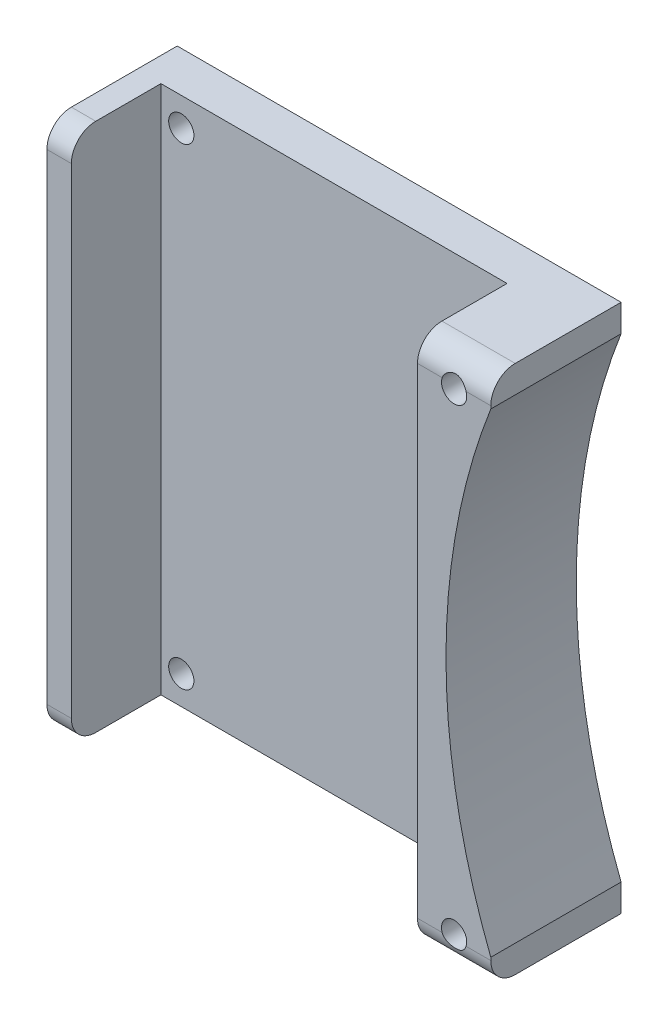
ISO-10303-21;
HEADER;
FILE_DESCRIPTION(('STEP AP214'),'2;1');
FILE_NAME('part.step','',(''),(''),'','','');
FILE_SCHEMA(('AUTOMOTIVE_DESIGN { 1 0 10303 214 1 1 1 1 }'));
ENDSEC;
DATA;
#1=APPLICATION_CONTEXT('core data for automotive mechanical design processes');
#2=APPLICATION_PROTOCOL_DEFINITION('international standard','automotive_design',2000,#1);
#3=PRODUCT_CONTEXT('',#1,'mechanical');
#4=PRODUCT('Part','Part','',(#3));
#5=PRODUCT_RELATED_PRODUCT_CATEGORY('part','',(#4));
#6=PRODUCT_DEFINITION_FORMATION('','',#4);
#7=PRODUCT_DEFINITION_CONTEXT('part definition',#1,'design');
#8=PRODUCT_DEFINITION('design','',#6,#7);
#9=PRODUCT_DEFINITION_SHAPE('','',#8);
#10=(LENGTH_UNIT() NAMED_UNIT(*) SI_UNIT(.MILLI.,.METRE.));
#11=(NAMED_UNIT(*) PLANE_ANGLE_UNIT() SI_UNIT($,.RADIAN.));
#12=(NAMED_UNIT(*) SI_UNIT($,.STERADIAN.) SOLID_ANGLE_UNIT());
#13=UNCERTAINTY_MEASURE_WITH_UNIT(LENGTH_MEASURE(1.E-05),#10,'distance_accuracy_value','');
#14=(GEOMETRIC_REPRESENTATION_CONTEXT(3) GLOBAL_UNCERTAINTY_ASSIGNED_CONTEXT((#13)) GLOBAL_UNIT_ASSIGNED_CONTEXT((#10,
#11,#12)) REPRESENTATION_CONTEXT('',''));
#15=CARTESIAN_POINT('',(0.,0.,0.));
#16=DIRECTION('',(0.,0.,1.));
#17=DIRECTION('',(1.,0.,0.));
#18=AXIS2_PLACEMENT_3D('',#15,#16,#17);
#19=CARTESIAN_POINT('',(22.75,-29.,-16.));
#20=DIRECTION('',(0.,0.,1.));
#21=DIRECTION('',(1.,0.,0.));
#22=AXIS2_PLACEMENT_3D('',#19,#20,#21);
#23=CYLINDRICAL_SURFACE('',#22,1.55);
#24=CARTESIAN_POINT('',(22.75,-29.,0.));
#25=DIRECTION('',(0.,0.,1.));
#26=DIRECTION('',(1.,0.,0.));
#27=AXIS2_PLACEMENT_3D('',#24,#25,#26);
#28=CIRCLE('',#27,1.55);
#29=CARTESIAN_POINT('',(21.2828599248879,-29.5,0.));
#30=VERTEX_POINT('',#29);
#31=CARTESIAN_POINT('',(24.2171400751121,-29.5000000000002,0.));
#32=VERTEX_POINT('',#31);
#33=EDGE_CURVE('E134',#30,#32,#28,.F.);
#34=ORIENTED_EDGE('',*,*,#33,.F.);
#35=CARTESIAN_POINT('',(24.217140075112,-29.5000000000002,0.));
#36=CARTESIAN_POINT('',(24.2034915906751,-29.5400543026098,3.61119810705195E-06));
#37=CARTESIAN_POINT('',(24.1882069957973,-29.5795229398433,-0.000802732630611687));
#38=CARTESIAN_POINT('',(24.154498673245,-29.6570143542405,-0.00386157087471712));
#39=CARTESIAN_POINT('',(24.1360766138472,-29.6950378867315,-0.00611329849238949));
#40=CARTESIAN_POINT('',(24.0764521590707,-29.8062698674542,-0.0147525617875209));
#41=CARTESIAN_POINT('',(24.0307708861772,-29.8769912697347,-0.0230271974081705));
#42=CARTESIAN_POINT('',(23.9289916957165,-30.0096904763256,-0.0428515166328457));
#43=CARTESIAN_POINT('',(23.872909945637,-30.0716815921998,-0.0543961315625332));
#44=CARTESIAN_POINT('',(23.75164367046,-30.185810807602,-0.0788575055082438));
#45=CARTESIAN_POINT('',(23.6864502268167,-30.2379391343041,-0.0917756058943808));
#46=CARTESIAN_POINT('',(23.5450672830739,-30.3334153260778,-0.117641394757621));
#47=CARTESIAN_POINT('',(23.468494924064,-30.3762060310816,-0.130559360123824));
#48=CARTESIAN_POINT('',(23.308886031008,-30.4483820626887,-0.153596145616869));
#49=CARTESIAN_POINT('',(23.2258516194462,-30.477771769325,-0.163715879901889));
#50=CARTESIAN_POINT('',(23.0566001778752,-30.5218566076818,-0.179298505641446));
#51=CARTESIAN_POINT('',(22.9704334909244,-30.5367243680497,-0.184815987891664));
#52=CARTESIAN_POINT('',(22.7966674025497,-30.5517472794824,-0.190391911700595));
#53=CARTESIAN_POINT('',(22.7090685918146,-30.5519083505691,-0.190452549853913));
#54=CARTESIAN_POINT('',(22.5402134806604,-30.5379402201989,-0.185266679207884));
#55=CARTESIAN_POINT('',(22.4588790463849,-30.5246202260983,-0.180320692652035));
#56=CARTESIAN_POINT('',(22.299667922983,-30.4854042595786,-0.166379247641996));
#57=CARTESIAN_POINT('',(22.2217918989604,-30.4595058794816,-0.157383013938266));
#58=CARTESIAN_POINT('',(22.0699866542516,-30.3953502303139,-0.136522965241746));
#59=CARTESIAN_POINT('',(21.9961590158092,-30.3568700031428,-0.12460847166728));
#60=CARTESIAN_POINT('',(21.8556766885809,-30.2686879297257,-0.0997910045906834));
#61=CARTESIAN_POINT('',(21.7890264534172,-30.2189791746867,-0.0868874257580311));
#62=CARTESIAN_POINT('',(21.6607995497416,-30.1062756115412,-0.0613000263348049));
#63=CARTESIAN_POINT('',(21.5997398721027,-30.0426783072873,-0.0486721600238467));
#64=CARTESIAN_POINT('',(21.4891123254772,-29.9057483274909,-0.0267614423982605));
#65=CARTESIAN_POINT('',(21.439525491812,-29.8324320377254,-0.0174730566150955));
#66=CARTESIAN_POINT('',(21.3737851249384,-29.7146392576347,-0.00740862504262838));
#67=CARTESIAN_POINT('',(21.3529052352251,-29.6729052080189,-0.00468419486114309));
#68=CARTESIAN_POINT('',(21.3149734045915,-29.5876853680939,-0.000977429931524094));
#69=CARTESIAN_POINT('',(21.2979195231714,-29.544200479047,5.78968746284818E-06));
#70=CARTESIAN_POINT('',(21.2828599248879,-29.5000000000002,0.));
#71=B_SPLINE_CURVE_WITH_KNOTS('',3,(#35,#36,#37,#38,#39,#40,#41,#42,#43,#44,#45,#46,#47,#48,#49,
#50,#51,#52,#53,#54,#55,#56,#57,#58,#59,#60,#61,#62,#63,#64,#65,#66,#67,#68,#69,#70),
.UNSPECIFIED.,.F.,.F.,(4,2,2,2,2,2,2,2,2,2,2,2,2,2,2,2,2,4),(0.,0.126855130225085,
0.253643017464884,0.506119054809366,0.758205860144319,1.01054115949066,1.27527280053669,
1.53991785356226,1.80137721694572,2.06273133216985,2.30927643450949,2.55586874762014,
2.80709189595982,3.05847004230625,3.32439890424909,3.58988499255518,3.72992282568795,
3.86988947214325),.UNSPECIFIED.);
#72=EDGE_CURVE('E188',#32,#30,#71,.T.);
#73=ORIENTED_EDGE('',*,*,#72,.F.);
#74=EDGE_LOOP('',(#34,#73));
#75=FACE_BOUND('',#74,.T.);
#76=CARTESIAN_POINT('',(22.75,-29.,-13.5));
#77=DIRECTION('',(0.,0.,1.));
#78=DIRECTION('',(1.,0.,0.));
#79=AXIS2_PLACEMENT_3D('',#76,#77,#78);
#80=CIRCLE('',#79,1.55);
#81=CARTESIAN_POINT('',(24.3,-29.,-13.5));
#82=VERTEX_POINT('',#81);
#83=EDGE_CURVE('E135',#82,#82,#80,.F.);
#84=ORIENTED_EDGE('',*,*,#83,.T.);
#85=EDGE_LOOP('',(#84));
#86=FACE_BOUND('',#85,.T.);
#87=ADVANCED_FACE('F16',(#75,#86),#23,.F.);
#88=CARTESIAN_POINT('',(22.75,29.,-16.));
#89=DIRECTION('',(0.,0.,1.));
#90=DIRECTION('',(1.,0.,0.));
#91=AXIS2_PLACEMENT_3D('',#88,#89,#90);
#92=CYLINDRICAL_SURFACE('',#91,1.55);
#93=CARTESIAN_POINT('',(22.75,29.,-13.5));
#94=DIRECTION('',(0.,0.,1.));
#95=DIRECTION('',(1.,0.,0.));
#96=AXIS2_PLACEMENT_3D('',#93,#94,#95);
#97=CIRCLE('',#96,1.55);
#98=CARTESIAN_POINT('',(24.3,29.,-13.5));
#99=VERTEX_POINT('',#98);
#100=EDGE_CURVE('E202',#99,#99,#97,.F.);
#101=ORIENTED_EDGE('',*,*,#100,.T.);
#102=EDGE_LOOP('',(#101));
#103=FACE_BOUND('',#102,.T.);
#104=CARTESIAN_POINT('',(22.75,29.,0.));
#105=DIRECTION('',(0.,0.,1.));
#106=DIRECTION('',(1.,0.,0.));
#107=AXIS2_PLACEMENT_3D('',#104,#105,#106);
#108=CIRCLE('',#107,1.55);
#109=CARTESIAN_POINT('',(24.2171400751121,29.5000000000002,0.));
#110=VERTEX_POINT('',#109);
#111=CARTESIAN_POINT('',(21.2828599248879,29.5000000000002,0.));
#112=VERTEX_POINT('',#111);
#113=EDGE_CURVE('E127',#110,#112,#108,.F.);
#114=ORIENTED_EDGE('',*,*,#113,.F.);
#115=CARTESIAN_POINT('',(21.282859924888,29.5000000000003,0.));
#116=CARTESIAN_POINT('',(21.2965084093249,29.5400543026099,3.61119810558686E-06));
#117=CARTESIAN_POINT('',(21.3117930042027,29.5795229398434,-0.000802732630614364));
#118=CARTESIAN_POINT('',(21.345501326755,29.6570143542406,-0.00386157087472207));
#119=CARTESIAN_POINT('',(21.3639233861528,29.6950378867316,-0.00611329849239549));
#120=CARTESIAN_POINT('',(21.4235478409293,29.8062698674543,-0.0147525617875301));
#121=CARTESIAN_POINT('',(21.4692291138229,29.8769912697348,-0.0230271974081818));
#122=CARTESIAN_POINT('',(21.5710083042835,30.0096904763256,-0.0428515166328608));
#123=CARTESIAN_POINT('',(21.627090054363,30.0716815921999,-0.0543961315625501));
#124=CARTESIAN_POINT('',(21.7483563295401,30.1858108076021,-0.0788575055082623));
#125=CARTESIAN_POINT('',(21.8135497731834,30.2379391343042,-0.0917756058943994));
#126=CARTESIAN_POINT('',(21.9549327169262,30.3334153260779,-0.117641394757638));
#127=CARTESIAN_POINT('',(22.0315050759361,30.3762060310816,-0.130559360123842));
#128=CARTESIAN_POINT('',(22.1911139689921,30.4483820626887,-0.153596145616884));
#129=CARTESIAN_POINT('',(22.2741483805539,30.477771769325,-0.163715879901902));
#130=CARTESIAN_POINT('',(22.4433998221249,30.5218566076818,-0.179298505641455));
#131=CARTESIAN_POINT('',(22.5295665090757,30.5367243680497,-0.18481598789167));
#132=CARTESIAN_POINT('',(22.7033325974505,30.5517472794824,-0.190391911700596));
#133=CARTESIAN_POINT('',(22.7909314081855,30.551908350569,-0.190452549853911));
#134=CARTESIAN_POINT('',(22.9597865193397,30.5379402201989,-0.185266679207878));
#135=CARTESIAN_POINT('',(23.0411209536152,30.5246202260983,-0.180320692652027));
#136=CARTESIAN_POINT('',(23.2003320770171,30.4854042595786,-0.166379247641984));
#137=CARTESIAN_POINT('',(23.2782081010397,30.4595058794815,-0.157383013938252));
#138=CARTESIAN_POINT('',(23.4300133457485,30.3953502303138,-0.13652296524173));
#139=CARTESIAN_POINT('',(23.5038409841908,30.3568700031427,-0.124608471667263));
#140=CARTESIAN_POINT('',(23.6443233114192,30.2686879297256,-0.0997910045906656));
#141=CARTESIAN_POINT('',(23.7109735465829,30.2189791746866,-0.0868874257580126));
#142=CARTESIAN_POINT('',(23.8392004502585,30.1062756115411,-0.0613000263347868));
#143=CARTESIAN_POINT('',(23.9002601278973,30.0426783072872,-0.0486721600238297));
#144=CARTESIAN_POINT('',(24.0108876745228,29.9057483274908,-0.0267614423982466));
#145=CARTESIAN_POINT('',(24.0604745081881,29.8324320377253,-0.0174730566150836));
#146=CARTESIAN_POINT('',(24.1262148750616,29.7146392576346,-0.0074086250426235));
#147=CARTESIAN_POINT('',(24.1470947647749,29.6729052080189,-0.0046841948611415));
#148=CARTESIAN_POINT('',(24.1850265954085,29.5876853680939,-0.000977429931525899));
#149=CARTESIAN_POINT('',(24.2020804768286,29.5442004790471,5.78968746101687E-06));
#150=CARTESIAN_POINT('',(24.217140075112,29.5000000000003,0.));
#151=B_SPLINE_CURVE_WITH_KNOTS('',3,(#115,#116,#117,#118,#119,#120,#121,#122,#123,#124,#125,
#126,#127,#128,#129,#130,#131,#132,#133,#134,#135,#136,#137,#138,#139,#140,#141,#142,#143,#144,
#145,#146,#147,#148,#149,#150),.UNSPECIFIED.,.F.,.F.,(4,2,2,2,2,2,2,2,2,2,2,2,2,2,2,2,2,4),(0.,
0.126855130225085,0.253643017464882,0.506119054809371,0.758205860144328,1.01054115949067,
1.27527280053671,1.53991785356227,1.80137721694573,2.06273133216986,2.3092764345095,
2.55586874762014,2.80709189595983,3.05847004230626,3.3243989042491,3.5898849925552,
3.72992282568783,3.86988947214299),.UNSPECIFIED.);
#152=EDGE_CURVE('E132',#112,#110,#151,.T.);
#153=ORIENTED_EDGE('',*,*,#152,.F.);
#154=EDGE_LOOP('',(#114,#153));
#155=FACE_BOUND('',#154,.T.);
#156=ADVANCED_FACE('F130',(#103,#155),#92,.F.);
#157=CARTESIAN_POINT('',(-21.75,29.,-16.));
#158=DIRECTION('',(0.,0.,1.));
#159=DIRECTION('',(1.,0.,0.));
#160=AXIS2_PLACEMENT_3D('',#157,#158,#159);
#161=CYLINDRICAL_SURFACE('',#160,1.55);
#162=CARTESIAN_POINT('',(-21.75,29.,-13.5));
#163=DIRECTION('',(0.,0.,1.));
#164=DIRECTION('',(1.,0.,0.));
#165=AXIS2_PLACEMENT_3D('',#162,#163,#164);
#166=CIRCLE('',#165,1.55);
#167=CARTESIAN_POINT('',(-20.2,29.,-13.5));
#168=VERTEX_POINT('',#167);
#169=EDGE_CURVE('E20',#168,#168,#166,.F.);
#170=ORIENTED_EDGE('',*,*,#169,.T.);
#171=EDGE_LOOP('',(#170));
#172=FACE_BOUND('',#171,.T.);
#173=CARTESIAN_POINT('',(-21.75,29.,-11.));
#174=DIRECTION('',(0.,0.,1.));
#175=DIRECTION('',(1.,0.,0.));
#176=AXIS2_PLACEMENT_3D('',#173,#174,#175);
#177=CIRCLE('',#176,1.55);
#178=CARTESIAN_POINT('',(-20.2,29.,-11.));
#179=VERTEX_POINT('',#178);
#180=EDGE_CURVE('E376',#179,#179,#177,.F.);
#181=ORIENTED_EDGE('',*,*,#180,.F.);
#182=EDGE_LOOP('',(#181));
#183=FACE_BOUND('',#182,.T.);
#184=ADVANCED_FACE('F211',(#172,#183),#161,.F.);
#185=CARTESIAN_POINT('',(-21.75,-29.,-16.));
#186=DIRECTION('',(0.,0.,1.));
#187=DIRECTION('',(1.,0.,0.));
#188=AXIS2_PLACEMENT_3D('',#185,#186,#187);
#189=CYLINDRICAL_SURFACE('',#188,1.55);
#190=CARTESIAN_POINT('',(-21.75,-29.,-13.5));
#191=DIRECTION('',(0.,0.,1.));
#192=DIRECTION('',(1.,0.,0.));
#193=AXIS2_PLACEMENT_3D('',#190,#191,#192);
#194=CIRCLE('',#193,1.55);
#195=CARTESIAN_POINT('',(-20.2,-29.,-13.5));
#196=VERTEX_POINT('',#195);
#197=EDGE_CURVE('E204',#196,#196,#194,.F.);
#198=ORIENTED_EDGE('',*,*,#197,.T.);
#199=EDGE_LOOP('',(#198));
#200=FACE_BOUND('',#199,.T.);
#201=CARTESIAN_POINT('',(-21.75,-29.,-11.));
#202=DIRECTION('',(0.,0.,1.));
#203=DIRECTION('',(1.,0.,0.));
#204=AXIS2_PLACEMENT_3D('',#201,#202,#203);
#205=CIRCLE('',#204,1.55);
#206=CARTESIAN_POINT('',(-20.2,-29.,-11.));
#207=VERTEX_POINT('',#206);
#208=EDGE_CURVE('E310',#207,#207,#205,.F.);
#209=ORIENTED_EDGE('',*,*,#208,.F.);
#210=EDGE_LOOP('',(#209));
#211=FACE_BOUND('',#210,.T.);
#212=ADVANCED_FACE('F217',(#200,#211),#189,.F.);
#213=CARTESIAN_POINT('',(-21.75,29.,-13.5));
#214=DIRECTION('',(0.,0.,1.));
#215=DIRECTION('',(1.,0.,0.));
#216=AXIS2_PLACEMENT_3D('',#213,#214,#215);
#217=PLANE('',#216);
#218=CARTESIAN_POINT('',(-21.75,29.,-13.5));
#219=DIRECTION('',(0.,0.,1.));
#220=DIRECTION('',(1.,0.,0.));
#221=AXIS2_PLACEMENT_3D('',#218,#219,#220);
#222=CIRCLE('',#221,3.);
#223=CARTESIAN_POINT('',(-18.75,29.,-13.5));
#224=VERTEX_POINT('',#223);
#225=EDGE_CURVE('E372',#224,#224,#222,.F.);
#226=ORIENTED_EDGE('',*,*,#225,.T.);
#227=EDGE_LOOP('',(#226));
#228=FACE_BOUND('',#227,.T.);
#229=ORIENTED_EDGE('',*,*,#169,.F.);
#230=EDGE_LOOP('',(#229));
#231=FACE_BOUND('',#230,.T.);
#232=ADVANCED_FACE('F214',(#228,#231),#217,.F.);
#233=CARTESIAN_POINT('',(-21.75,-29.,-13.5));
#234=DIRECTION('',(0.,0.,1.));
#235=DIRECTION('',(1.,0.,0.));
#236=AXIS2_PLACEMENT_3D('',#233,#234,#235);
#237=PLANE('',#236);
#238=CARTESIAN_POINT('',(-21.75,-29.,-13.5));
#239=DIRECTION('',(0.,0.,1.));
#240=DIRECTION('',(1.,0.,0.));
#241=AXIS2_PLACEMENT_3D('',#238,#239,#240);
#242=CIRCLE('',#241,3.);
#243=CARTESIAN_POINT('',(-18.75,-29.,-13.5));
#244=VERTEX_POINT('',#243);
#245=EDGE_CURVE('E369',#244,#244,#242,.F.);
#246=ORIENTED_EDGE('',*,*,#245,.T.);
#247=EDGE_LOOP('',(#246));
#248=FACE_BOUND('',#247,.T.);
#249=ORIENTED_EDGE('',*,*,#197,.F.);
#250=EDGE_LOOP('',(#249));
#251=FACE_BOUND('',#250,.T.);
#252=ADVANCED_FACE('F216',(#248,#251),#237,.F.);
#253=CARTESIAN_POINT('',(22.75,29.,-13.5));
#254=DIRECTION('',(0.,0.,1.));
#255=DIRECTION('',(1.,0.,0.));
#256=AXIS2_PLACEMENT_3D('',#253,#254,#255);
#257=PLANE('',#256);
#258=CARTESIAN_POINT('',(22.75,29.,-13.5));
#259=DIRECTION('',(0.,0.,1.));
#260=DIRECTION('',(1.,0.,0.));
#261=AXIS2_PLACEMENT_3D('',#258,#259,#260);
#262=CIRCLE('',#261,3.);
#263=CARTESIAN_POINT('',(25.75,29.,-13.5));
#264=VERTEX_POINT('',#263);
#265=EDGE_CURVE('E366',#264,#264,#262,.F.);
#266=ORIENTED_EDGE('',*,*,#265,.T.);
#267=EDGE_LOOP('',(#266));
#268=FACE_BOUND('',#267,.T.);
#269=ORIENTED_EDGE('',*,*,#100,.F.);
#270=EDGE_LOOP('',(#269));
#271=FACE_BOUND('',#270,.T.);
#272=ADVANCED_FACE('F225',(#268,#271),#257,.F.);
#273=CARTESIAN_POINT('',(22.75,-29.,-13.5));
#274=DIRECTION('',(0.,0.,1.));
#275=DIRECTION('',(1.,0.,0.));
#276=AXIS2_PLACEMENT_3D('',#273,#274,#275);
#277=PLANE('',#276);
#278=CARTESIAN_POINT('',(22.75,-29.,-13.5));
#279=DIRECTION('',(0.,0.,1.));
#280=DIRECTION('',(1.,0.,0.));
#281=AXIS2_PLACEMENT_3D('',#278,#279,#280);
#282=CIRCLE('',#281,3.);
#283=CARTESIAN_POINT('',(25.75,-29.,-13.5));
#284=VERTEX_POINT('',#283);
#285=EDGE_CURVE('E363',#284,#284,#282,.F.);
#286=ORIENTED_EDGE('',*,*,#285,.T.);
#287=EDGE_LOOP('',(#286));
#288=FACE_BOUND('',#287,.T.);
#289=ORIENTED_EDGE('',*,*,#83,.F.);
#290=EDGE_LOOP('',(#289));
#291=FACE_BOUND('',#290,.T.);
#292=ADVANCED_FACE('F474',(#288,#291),#277,.F.);
#293=CARTESIAN_POINT('',(18.25,-32.5,0.));
#294=DIRECTION('',(0.,0.,1.));
#295=DIRECTION('',(1.,0.,0.));
#296=AXIS2_PLACEMENT_3D('',#293,#294,#295);
#297=PLANE('',#296);
#298=CARTESIAN_POINT('',(101.75,0.,0.));
#299=DIRECTION('',(0.,0.,-1.));
#300=DIRECTION('',(-1.,0.,0.));
#301=AXIS2_PLACEMENT_3D('',#298,#299,#300);
#302=CIRCLE('',#301,80.);
#303=CARTESIAN_POINT('',(27.25,-29.1504716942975,0.));
#304=VERTEX_POINT('',#303);
#305=CARTESIAN_POINT('',(27.2500000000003,29.1504716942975,0.));
#306=VERTEX_POINT('',#305);
#307=EDGE_CURVE('E358',#304,#306,#302,.T.);
#308=ORIENTED_EDGE('',*,*,#307,.T.);
#309=DIRECTION('',(0.,1.,0.));
#310=VECTOR('',#309,1.);
#311=CARTESIAN_POINT('',(27.25,-32.5,0.));
#312=LINE('',#311,#310);
#313=CARTESIAN_POINT('',(27.25,29.5000000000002,0.));
#314=VERTEX_POINT('',#313);
#315=EDGE_CURVE('E141',#314,#306,#312,.F.);
#316=ORIENTED_EDGE('',*,*,#315,.F.);
#317=DIRECTION('',(1.,0.,0.));
#318=VECTOR('',#317,1.);
#319=CARTESIAN_POINT('',(18.11727181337,29.5000000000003,0.));
#320=LINE('',#319,#318);
#321=EDGE_CURVE('E138',#110,#314,#320,.T.);
#322=ORIENTED_EDGE('',*,*,#321,.F.);
#323=ORIENTED_EDGE('',*,*,#113,.T.);
#324=DIRECTION('',(1.,0.,0.));
#325=VECTOR('',#324,1.);
#326=CARTESIAN_POINT('',(18.11727181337,29.5,0.));
#327=LINE('',#326,#325);
#328=CARTESIAN_POINT('',(18.25,29.5,0.));
#329=VERTEX_POINT('',#328);
#330=EDGE_CURVE('E149',#329,#112,#327,.T.);
#331=ORIENTED_EDGE('',*,*,#330,.F.);
#332=DIRECTION('',(0.,1.,0.));
#333=VECTOR('',#332,1.);
#334=CARTESIAN_POINT('',(18.25,-32.5,0.));
#335=LINE('',#334,#333);
#336=CARTESIAN_POINT('',(18.25,-29.5,0.));
#337=VERTEX_POINT('',#336);
#338=EDGE_CURVE('E392',#337,#329,#335,.T.);
#339=ORIENTED_EDGE('',*,*,#338,.F.);
#340=DIRECTION('',(1.,0.,0.));
#341=VECTOR('',#340,1.);
#342=CARTESIAN_POINT('',(18.25,-29.5,0.));
#343=LINE('',#342,#341);
#344=EDGE_CURVE('E194',#30,#337,#343,.F.);
#345=ORIENTED_EDGE('',*,*,#344,.F.);
#346=ORIENTED_EDGE('',*,*,#33,.T.);
#347=DIRECTION('',(1.,0.,0.));
#348=VECTOR('',#347,1.);
#349=CARTESIAN_POINT('',(18.25,-29.5000000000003,0.));
#350=LINE('',#349,#348);
#351=CARTESIAN_POINT('',(27.25,-29.5000000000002,0.));
#352=VERTEX_POINT('',#351);
#353=EDGE_CURVE('E195',#352,#32,#350,.F.);
#354=ORIENTED_EDGE('',*,*,#353,.F.);
#355=DIRECTION('',(0.,1.,0.));
#356=VECTOR('',#355,1.);
#357=CARTESIAN_POINT('',(27.25,-32.5,0.));
#358=LINE('',#357,#356);
#359=EDGE_CURVE('E198',#352,#304,#358,.T.);
#360=ORIENTED_EDGE('',*,*,#359,.T.);
#361=EDGE_LOOP('',(#308,#316,#322,#323,#331,#339,#345,#346,#354,#360));
#362=FACE_BOUND('',#361,.T.);
#363=ADVANCED_FACE('F139',(#362),#297,.T.);
#364=CARTESIAN_POINT('',(27.37762166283,-29.5,-3.));
#365=DIRECTION('',(-1.,0.,0.));
#366=DIRECTION('',(0.,0.,1.));
#367=AXIS2_PLACEMENT_3D('',#364,#365,#366);
#368=CYLINDRICAL_SURFACE('',#367,3.);
#369=DIRECTION('',(1.,0.,0.));
#370=VECTOR('',#369,1.);
#371=CARTESIAN_POINT('',(0.,-32.5,-3.));
#372=LINE('',#371,#370);
#373=CARTESIAN_POINT('',(18.25,-32.5,-3.));
#374=VERTEX_POINT('',#373);
#375=CARTESIAN_POINT('',(27.25,-32.5,-3.));
#376=VERTEX_POINT('',#375);
#377=EDGE_CURVE('E325',#374,#376,#372,.T.);
#378=ORIENTED_EDGE('',*,*,#377,.T.);
#379=CARTESIAN_POINT('',(27.25,-29.5,-3.));
#380=DIRECTION('',(-1.,0.,0.));
#381=DIRECTION('',(0.,0.,1.));
#382=AXIS2_PLACEMENT_3D('',#379,#380,#381);
#383=CIRCLE('',#382,3.);
#384=EDGE_CURVE('E329',#352,#376,#383,.F.);
#385=ORIENTED_EDGE('',*,*,#384,.F.);
#386=ORIENTED_EDGE('',*,*,#353,.T.);
#387=ORIENTED_EDGE('',*,*,#72,.T.);
#388=ORIENTED_EDGE('',*,*,#344,.T.);
#389=CARTESIAN_POINT('',(18.25,-29.5,-3.));
#390=DIRECTION('',(-1.,0.,0.));
#391=DIRECTION('',(0.,0.,1.));
#392=AXIS2_PLACEMENT_3D('',#389,#390,#391);
#393=CIRCLE('',#392,3.);
#394=EDGE_CURVE('E151',#374,#337,#393,.T.);
#395=ORIENTED_EDGE('',*,*,#394,.F.);
#396=EDGE_LOOP('',(#378,#385,#386,#387,#388,#395));
#397=FACE_BOUND('',#396,.T.);
#398=ADVANCED_FACE('F180',(#397),#368,.T.);
#399=CARTESIAN_POINT('',(-27.25,-32.5,0.));
#400=DIRECTION('',(0.,0.,1.));
#401=DIRECTION('',(1.,0.,0.));
#402=AXIS2_PLACEMENT_3D('',#399,#400,#401);
#403=PLANE('',#402);
#404=DIRECTION('',(0.,1.,0.));
#405=VECTOR('',#404,1.);
#406=CARTESIAN_POINT('',(-27.25,-32.5,0.));
#407=LINE('',#406,#405);
#408=CARTESIAN_POINT('',(-27.25,-29.5,0.));
#409=VERTEX_POINT('',#408);
#410=CARTESIAN_POINT('',(-27.25,29.5,0.));
#411=VERTEX_POINT('',#410);
#412=EDGE_CURVE('E315',#409,#411,#407,.T.);
#413=ORIENTED_EDGE('',*,*,#412,.F.);
#414=DIRECTION('',(-1.,0.,0.));
#415=VECTOR('',#414,1.);
#416=CARTESIAN_POINT('',(-24.06145222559,-29.5,0.));
#417=LINE('',#416,#415);
#418=CARTESIAN_POINT('',(-24.25,-29.5,0.));
#419=VERTEX_POINT('',#418);
#420=EDGE_CURVE('E389',#419,#409,#417,.T.);
#421=ORIENTED_EDGE('',*,*,#420,.F.);
#422=DIRECTION('',(0.,1.,0.));
#423=VECTOR('',#422,1.);
#424=CARTESIAN_POINT('',(-24.25,-32.5,0.));
#425=LINE('',#424,#423);
#426=CARTESIAN_POINT('',(-24.25,29.5,0.));
#427=VERTEX_POINT('',#426);
#428=EDGE_CURVE('E379',#427,#419,#425,.F.);
#429=ORIENTED_EDGE('',*,*,#428,.F.);
#430=DIRECTION('',(1.,0.,0.));
#431=VECTOR('',#430,1.);
#432=CARTESIAN_POINT('',(-27.38272818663,29.5,0.));
#433=LINE('',#432,#431);
#434=EDGE_CURVE('E382',#411,#427,#433,.T.);
#435=ORIENTED_EDGE('',*,*,#434,.F.);
#436=EDGE_LOOP('',(#413,#421,#429,#435));
#437=FACE_BOUND('',#436,.T.);
#438=ADVANCED_FACE('F176',(#437),#403,.T.);
#439=CARTESIAN_POINT('',(-24.06145222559,-29.5,-3.));
#440=DIRECTION('',(-1.,0.,0.));
#441=DIRECTION('',(0.,0.,1.));
#442=AXIS2_PLACEMENT_3D('',#439,#440,#441);
#443=CYLINDRICAL_SURFACE('',#442,3.);
#444=CARTESIAN_POINT('',(-24.25,-29.5,-3.));
#445=DIRECTION('',(-1.,0.,0.));
#446=DIRECTION('',(0.,0.,1.));
#447=AXIS2_PLACEMENT_3D('',#444,#445,#446);
#448=CIRCLE('',#447,3.);
#449=CARTESIAN_POINT('',(-24.25,-32.5,-3.));
#450=VERTEX_POINT('',#449);
#451=EDGE_CURVE('E297',#419,#450,#448,.F.);
#452=ORIENTED_EDGE('',*,*,#451,.F.);
#453=ORIENTED_EDGE('',*,*,#420,.T.);
#454=CARTESIAN_POINT('',(-27.25,-29.5,-3.));
#455=DIRECTION('',(-1.,0.,0.));
#456=DIRECTION('',(0.,0.,1.));
#457=AXIS2_PLACEMENT_3D('',#454,#455,#456);
#458=CIRCLE('',#457,3.);
#459=CARTESIAN_POINT('',(-27.25,-32.5,-3.));
#460=VERTEX_POINT('',#459);
#461=EDGE_CURVE('E349',#460,#409,#458,.T.);
#462=ORIENTED_EDGE('',*,*,#461,.F.);
#463=DIRECTION('',(1.,0.,0.));
#464=VECTOR('',#463,1.);
#465=CARTESIAN_POINT('',(0.,-32.5,-3.));
#466=LINE('',#465,#464);
#467=EDGE_CURVE('E300',#460,#450,#466,.T.);
#468=ORIENTED_EDGE('',*,*,#467,.T.);
#469=EDGE_LOOP('',(#452,#453,#462,#468));
#470=FACE_BOUND('',#469,.T.);
#471=ADVANCED_FACE('F172',(#470),#443,.T.);
#472=CARTESIAN_POINT('',(18.25,-32.5,-11.));
#473=DIRECTION('',(-1.,0.,0.));
#474=DIRECTION('',(0.,0.,1.));
#475=AXIS2_PLACEMENT_3D('',#472,#473,#474);
#476=PLANE('',#475);
#477=DIRECTION('',(0.,0.,1.));
#478=VECTOR('',#477,1.);
#479=CARTESIAN_POINT('',(18.25,-32.5,0.));
#480=LINE('',#479,#478);
#481=CARTESIAN_POINT('',(18.25,-32.5,-11.));
#482=VERTEX_POINT('',#481);
#483=EDGE_CURVE('E314',#482,#374,#480,.T.);
#484=ORIENTED_EDGE('',*,*,#483,.T.);
#485=ORIENTED_EDGE('',*,*,#394,.T.);
#486=ORIENTED_EDGE('',*,*,#338,.T.);
#487=CARTESIAN_POINT('',(18.25,29.5,-3.));
#488=DIRECTION('',(1.,0.,0.));
#489=DIRECTION('',(0.,0.,-1.));
#490=AXIS2_PLACEMENT_3D('',#487,#488,#489);
#491=CIRCLE('',#490,3.);
#492=CARTESIAN_POINT('',(18.25,32.5,-3.));
#493=VERTEX_POINT('',#492);
#494=EDGE_CURVE('E144',#493,#329,#491,.T.);
#495=ORIENTED_EDGE('',*,*,#494,.F.);
#496=DIRECTION('',(0.,0.,1.));
#497=VECTOR('',#496,1.);
#498=CARTESIAN_POINT('',(18.25,32.5,0.));
#499=LINE('',#498,#497);
#500=CARTESIAN_POINT('',(18.25,32.5,-11.));
#501=VERTEX_POINT('',#500);
#502=EDGE_CURVE('E352',#501,#493,#499,.T.);
#503=ORIENTED_EDGE('',*,*,#502,.F.);
#504=DIRECTION('',(0.,1.,0.));
#505=VECTOR('',#504,1.);
#506=CARTESIAN_POINT('',(18.25,-32.5,-11.));
#507=LINE('',#506,#505);
#508=EDGE_CURVE('E309',#482,#501,#507,.T.);
#509=ORIENTED_EDGE('',*,*,#508,.F.);
#510=EDGE_LOOP('',(#484,#485,#486,#495,#503,#509));
#511=FACE_BOUND('',#510,.T.);
#512=ADVANCED_FACE('F168',(#511),#476,.T.);
#513=CARTESIAN_POINT('',(18.11727181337,29.5,-3.));
#514=DIRECTION('',(1.,0.,0.));
#515=DIRECTION('',(0.,0.,-1.));
#516=AXIS2_PLACEMENT_3D('',#513,#514,#515);
#517=CYLINDRICAL_SURFACE('',#516,3.);
#518=DIRECTION('',(1.,0.,0.));
#519=VECTOR('',#518,1.);
#520=CARTESIAN_POINT('',(0.,32.5,-3.));
#521=LINE('',#520,#519);
#522=CARTESIAN_POINT('',(27.25,32.5,-3.));
#523=VERTEX_POINT('',#522);
#524=EDGE_CURVE('E401',#493,#523,#521,.T.);
#525=ORIENTED_EDGE('',*,*,#524,.F.);
#526=ORIENTED_EDGE('',*,*,#494,.T.);
#527=ORIENTED_EDGE('',*,*,#330,.T.);
#528=ORIENTED_EDGE('',*,*,#152,.T.);
#529=ORIENTED_EDGE('',*,*,#321,.T.);
#530=CARTESIAN_POINT('',(27.25,29.5,-3.));
#531=DIRECTION('',(1.,0.,0.));
#532=DIRECTION('',(0.,0.,-1.));
#533=AXIS2_PLACEMENT_3D('',#530,#531,#532);
#534=CIRCLE('',#533,3.);
#535=EDGE_CURVE('E361',#523,#314,#534,.T.);
#536=ORIENTED_EDGE('',*,*,#535,.F.);
#537=EDGE_LOOP('',(#525,#526,#527,#528,#529,#536));
#538=FACE_BOUND('',#537,.T.);
#539=ADVANCED_FACE('F147',(#538),#517,.T.);
#540=CARTESIAN_POINT('',(-27.38272818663,29.5,-3.));
#541=DIRECTION('',(1.,0.,0.));
#542=DIRECTION('',(0.,0.,-1.));
#543=AXIS2_PLACEMENT_3D('',#540,#541,#542);
#544=CYLINDRICAL_SURFACE('',#543,3.);
#545=CARTESIAN_POINT('',(-27.25,29.5,-3.));
#546=DIRECTION('',(1.,0.,0.));
#547=DIRECTION('',(0.,0.,-1.));
#548=AXIS2_PLACEMENT_3D('',#545,#546,#547);
#549=CIRCLE('',#548,3.);
#550=CARTESIAN_POINT('',(-27.25,32.5,-3.));
#551=VERTEX_POINT('',#550);
#552=EDGE_CURVE('E318',#411,#551,#549,.F.);
#553=ORIENTED_EDGE('',*,*,#552,.F.);
#554=ORIENTED_EDGE('',*,*,#434,.T.);
#555=CARTESIAN_POINT('',(-24.25,29.5,-3.));
#556=DIRECTION('',(1.,0.,0.));
#557=DIRECTION('',(0.,0.,-1.));
#558=AXIS2_PLACEMENT_3D('',#555,#556,#557);
#559=CIRCLE('',#558,3.);
#560=CARTESIAN_POINT('',(-24.25,32.5,-3.));
#561=VERTEX_POINT('',#560);
#562=EDGE_CURVE('E380',#561,#427,#559,.T.);
#563=ORIENTED_EDGE('',*,*,#562,.F.);
#564=DIRECTION('',(1.,0.,0.));
#565=VECTOR('',#564,1.);
#566=CARTESIAN_POINT('',(0.,32.5,-3.));
#567=LINE('',#566,#565);
#568=EDGE_CURVE('E413',#551,#561,#567,.T.);
#569=ORIENTED_EDGE('',*,*,#568,.F.);
#570=EDGE_LOOP('',(#553,#554,#563,#569));
#571=FACE_BOUND('',#570,.T.);
#572=ADVANCED_FACE('F167',(#571),#544,.T.);
#573=CARTESIAN_POINT('',(-24.25,-32.5,0.));
#574=DIRECTION('',(1.,0.,0.));
#575=DIRECTION('',(0.,0.,-1.));
#576=AXIS2_PLACEMENT_3D('',#573,#574,#575);
#577=PLANE('',#576);
#578=DIRECTION('',(0.,0.,1.));
#579=VECTOR('',#578,1.);
#580=CARTESIAN_POINT('',(-24.25,-32.5,0.));
#581=LINE('',#580,#579);
#582=CARTESIAN_POINT('',(-24.25,-32.5,-11.));
#583=VERTEX_POINT('',#582);
#584=EDGE_CURVE('E290',#450,#583,#581,.F.);
#585=ORIENTED_EDGE('',*,*,#584,.T.);
#586=DIRECTION('',(0.,1.,0.));
#587=VECTOR('',#586,1.);
#588=CARTESIAN_POINT('',(-24.25,-32.5,-11.));
#589=LINE('',#588,#587);
#590=CARTESIAN_POINT('',(-24.25,32.5,-11.));
#591=VERTEX_POINT('',#590);
#592=EDGE_CURVE('E293',#591,#583,#589,.F.);
#593=ORIENTED_EDGE('',*,*,#592,.F.);
#594=DIRECTION('',(0.,0.,1.));
#595=VECTOR('',#594,1.);
#596=CARTESIAN_POINT('',(-24.25,32.5,0.));
#597=LINE('',#596,#595);
#598=EDGE_CURVE('E419',#561,#591,#597,.F.);
#599=ORIENTED_EDGE('',*,*,#598,.F.);
#600=ORIENTED_EDGE('',*,*,#562,.T.);
#601=ORIENTED_EDGE('',*,*,#428,.T.);
#602=ORIENTED_EDGE('',*,*,#451,.T.);
#603=EDGE_LOOP('',(#585,#593,#599,#600,#601,#602));
#604=FACE_BOUND('',#603,.T.);
#605=ADVANCED_FACE('F280',(#604),#577,.T.);
#606=CARTESIAN_POINT('',(-24.25,-32.5,-11.));
#607=DIRECTION('',(0.,0.,1.));
#608=DIRECTION('',(1.,0.,0.));
#609=AXIS2_PLACEMENT_3D('',#606,#607,#608);
#610=PLANE('',#609);
#611=ORIENTED_EDGE('',*,*,#508,.T.);
#612=DIRECTION('',(1.,0.,0.));
#613=VECTOR('',#612,1.);
#614=CARTESIAN_POINT('',(0.,32.5,-11.));
#615=LINE('',#614,#613);
#616=EDGE_CURVE('E307',#591,#501,#615,.T.);
#617=ORIENTED_EDGE('',*,*,#616,.F.);
#618=ORIENTED_EDGE('',*,*,#592,.T.);
#619=DIRECTION('',(1.,0.,0.));
#620=VECTOR('',#619,1.);
#621=CARTESIAN_POINT('',(0.,-32.5,-11.));
#622=LINE('',#621,#620);
#623=EDGE_CURVE('E299',#583,#482,#622,.T.);
#624=ORIENTED_EDGE('',*,*,#623,.T.);
#625=EDGE_LOOP('',(#611,#617,#618,#624));
#626=FACE_BOUND('',#625,.T.);
#627=ORIENTED_EDGE('',*,*,#208,.T.);
#628=EDGE_LOOP('',(#627));
#629=FACE_BOUND('',#628,.T.);
#630=ORIENTED_EDGE('',*,*,#180,.T.);
#631=EDGE_LOOP('',(#630));
#632=FACE_BOUND('',#631,.T.);
#633=ADVANCED_FACE('F277',(#626,#629,#632),#610,.T.);
#634=CARTESIAN_POINT('',(-21.75,29.,-16.));
#635=DIRECTION('',(0.,0.,1.));
#636=DIRECTION('',(1.,0.,0.));
#637=AXIS2_PLACEMENT_3D('',#634,#635,#636);
#638=CYLINDRICAL_SURFACE('',#637,3.);
#639=ORIENTED_EDGE('',*,*,#225,.F.);
#640=EDGE_LOOP('',(#639));
#641=FACE_BOUND('',#640,.T.);
#642=CARTESIAN_POINT('',(-21.75,29.,-16.));
#643=DIRECTION('',(0.,0.,1.));
#644=DIRECTION('',(1.,0.,0.));
#645=AXIS2_PLACEMENT_3D('',#642,#643,#644);
#646=CIRCLE('',#645,3.);
#647=CARTESIAN_POINT('',(-18.75,29.,-16.));
#648=VERTEX_POINT('',#647);
#649=EDGE_CURVE('E346',#648,#648,#646,.T.);
#650=ORIENTED_EDGE('',*,*,#649,.F.);
#651=EDGE_LOOP('',(#650));
#652=FACE_BOUND('',#651,.T.);
#653=ADVANCED_FACE('F273',(#641,#652),#638,.F.);
#654=CARTESIAN_POINT('',(-21.75,-29.,-16.));
#655=DIRECTION('',(0.,0.,1.));
#656=DIRECTION('',(1.,0.,0.));
#657=AXIS2_PLACEMENT_3D('',#654,#655,#656);
#658=CYLINDRICAL_SURFACE('',#657,3.);
#659=ORIENTED_EDGE('',*,*,#245,.F.);
#660=EDGE_LOOP('',(#659));
#661=FACE_BOUND('',#660,.T.);
#662=CARTESIAN_POINT('',(-21.75,-29.,-16.));
#663=DIRECTION('',(0.,0.,1.));
#664=DIRECTION('',(1.,0.,0.));
#665=AXIS2_PLACEMENT_3D('',#662,#663,#664);
#666=CIRCLE('',#665,3.);
#667=CARTESIAN_POINT('',(-18.75,-29.,-16.));
#668=VERTEX_POINT('',#667);
#669=EDGE_CURVE('E343',#668,#668,#666,.T.);
#670=ORIENTED_EDGE('',*,*,#669,.F.);
#671=EDGE_LOOP('',(#670));
#672=FACE_BOUND('',#671,.T.);
#673=ADVANCED_FACE('F269',(#661,#672),#658,.F.);
#674=CARTESIAN_POINT('',(22.75,29.,-16.));
#675=DIRECTION('',(0.,0.,1.));
#676=DIRECTION('',(1.,0.,0.));
#677=AXIS2_PLACEMENT_3D('',#674,#675,#676);
#678=CYLINDRICAL_SURFACE('',#677,3.);
#679=ORIENTED_EDGE('',*,*,#265,.F.);
#680=EDGE_LOOP('',(#679));
#681=FACE_BOUND('',#680,.T.);
#682=CARTESIAN_POINT('',(22.75,29.,-16.));
#683=DIRECTION('',(0.,0.,1.));
#684=DIRECTION('',(1.,0.,0.));
#685=AXIS2_PLACEMENT_3D('',#682,#683,#684);
#686=CIRCLE('',#685,3.);
#687=CARTESIAN_POINT('',(25.75,29.,-16.));
#688=VERTEX_POINT('',#687);
#689=EDGE_CURVE('E340',#688,#688,#686,.T.);
#690=ORIENTED_EDGE('',*,*,#689,.F.);
#691=EDGE_LOOP('',(#690));
#692=FACE_BOUND('',#691,.T.);
#693=ADVANCED_FACE('F265',(#681,#692),#678,.F.);
#694=CARTESIAN_POINT('',(22.75,-29.,-16.));
#695=DIRECTION('',(0.,0.,1.));
#696=DIRECTION('',(1.,0.,0.));
#697=AXIS2_PLACEMENT_3D('',#694,#695,#696);
#698=CYLINDRICAL_SURFACE('',#697,3.);
#699=ORIENTED_EDGE('',*,*,#285,.F.);
#700=EDGE_LOOP('',(#699));
#701=FACE_BOUND('',#700,.T.);
#702=CARTESIAN_POINT('',(22.75,-29.,-16.));
#703=DIRECTION('',(0.,0.,1.));
#704=DIRECTION('',(1.,0.,0.));
#705=AXIS2_PLACEMENT_3D('',#702,#703,#704);
#706=CIRCLE('',#705,3.);
#707=CARTESIAN_POINT('',(25.75,-29.,-16.));
#708=VERTEX_POINT('',#707);
#709=EDGE_CURVE('E337',#708,#708,#706,.T.);
#710=ORIENTED_EDGE('',*,*,#709,.F.);
#711=EDGE_LOOP('',(#710));
#712=FACE_BOUND('',#711,.T.);
#713=ADVANCED_FACE('F261',(#701,#712),#698,.F.);
#714=CARTESIAN_POINT('',(27.25,-32.5,0.));
#715=DIRECTION('',(1.,0.,0.));
#716=DIRECTION('',(0.,0.,-1.));
#717=AXIS2_PLACEMENT_3D('',#714,#715,#716);
#718=PLANE('',#717);
#719=DIRECTION('',(0.,0.,1.));
#720=VECTOR('',#719,1.);
#721=CARTESIAN_POINT('',(27.25,32.5,0.));
#722=LINE('',#721,#720);
#723=CARTESIAN_POINT('',(27.25,32.5,-16.));
#724=VERTEX_POINT('',#723);
#725=EDGE_CURVE('E405',#523,#724,#722,.F.);
#726=ORIENTED_EDGE('',*,*,#725,.F.);
#727=ORIENTED_EDGE('',*,*,#535,.T.);
#728=ORIENTED_EDGE('',*,*,#315,.T.);
#729=DIRECTION('',(0.,0.,-1.));
#730=VECTOR('',#729,1.);
#731=CARTESIAN_POINT('',(27.2500000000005,29.1504716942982,-16.));
#732=LINE('',#731,#730);
#733=CARTESIAN_POINT('',(27.2500000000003,29.1504716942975,-16.));
#734=VERTEX_POINT('',#733);
#735=EDGE_CURVE('E360',#306,#734,#732,.T.);
#736=ORIENTED_EDGE('',*,*,#735,.T.);
#737=DIRECTION('',(0.,1.,0.));
#738=VECTOR('',#737,1.);
#739=CARTESIAN_POINT('',(27.25,-32.5,-16.));
#740=LINE('',#739,#738);
#741=EDGE_CURVE('E336',#724,#734,#740,.F.);
#742=ORIENTED_EDGE('',*,*,#741,.F.);
#743=EDGE_LOOP('',(#726,#727,#728,#736,#742));
#744=FACE_BOUND('',#743,.T.);
#745=ADVANCED_FACE('F257',(#744),#718,.T.);
#746=CARTESIAN_POINT('',(101.75,0.,-16.));
#747=DIRECTION('',(0.,0.,-1.));
#748=DIRECTION('',(-1.,0.,0.));
#749=AXIS2_PLACEMENT_3D('',#746,#747,#748);
#750=CYLINDRICAL_SURFACE('',#749,80.);
#751=ORIENTED_EDGE('',*,*,#307,.F.);
#752=DIRECTION('',(0.,0.,-1.));
#753=VECTOR('',#752,1.);
#754=CARTESIAN_POINT('',(27.25,-29.1504716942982,0.));
#755=LINE('',#754,#753);
#756=CARTESIAN_POINT('',(27.2500000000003,-29.1504716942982,-16.));
#757=VERTEX_POINT('',#756);
#758=EDGE_CURVE('E357',#757,#304,#755,.F.);
#759=ORIENTED_EDGE('',*,*,#758,.F.);
#760=CARTESIAN_POINT('',(101.75,0.,-16.));
#761=DIRECTION('',(0.,0.,-1.));
#762=DIRECTION('',(-1.,0.,0.));
#763=AXIS2_PLACEMENT_3D('',#760,#761,#762);
#764=CIRCLE('',#763,80.);
#765=EDGE_CURVE('E333',#734,#757,#764,.F.);
#766=ORIENTED_EDGE('',*,*,#765,.F.);
#767=ORIENTED_EDGE('',*,*,#735,.F.);
#768=EDGE_LOOP('',(#751,#759,#766,#767));
#769=FACE_BOUND('',#768,.T.);
#770=ADVANCED_FACE('F253',(#769),#750,.F.);
#771=CARTESIAN_POINT('',(27.25,-32.5,0.));
#772=DIRECTION('',(1.,0.,0.));
#773=DIRECTION('',(0.,0.,-1.));
#774=AXIS2_PLACEMENT_3D('',#771,#772,#773);
#775=PLANE('',#774);
#776=ORIENTED_EDGE('',*,*,#384,.T.);
#777=DIRECTION('',(0.,0.,1.));
#778=VECTOR('',#777,1.);
#779=CARTESIAN_POINT('',(27.25,-32.5,0.));
#780=LINE('',#779,#778);
#781=CARTESIAN_POINT('',(27.2500000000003,-32.5,-16.));
#782=VERTEX_POINT('',#781);
#783=EDGE_CURVE('E327',#376,#782,#780,.F.);
#784=ORIENTED_EDGE('',*,*,#783,.T.);
#785=DIRECTION('',(0.,1.,0.));
#786=VECTOR('',#785,1.);
#787=CARTESIAN_POINT('',(27.2500000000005,-32.5,-16.));
#788=LINE('',#787,#786);
#789=EDGE_CURVE('E335',#757,#782,#788,.F.);
#790=ORIENTED_EDGE('',*,*,#789,.F.);
#791=ORIENTED_EDGE('',*,*,#758,.T.);
#792=ORIENTED_EDGE('',*,*,#359,.F.);
#793=EDGE_LOOP('',(#776,#784,#790,#791,#792));
#794=FACE_BOUND('',#793,.T.);
#795=ADVANCED_FACE('F249',(#794),#775,.T.);
#796=CARTESIAN_POINT('',(0.,-32.5,0.));
#797=DIRECTION('',(0.,1.,0.));
#798=DIRECTION('',(0.,0.,1.));
#799=AXIS2_PLACEMENT_3D('',#796,#797,#798);
#800=PLANE('',#799);
#801=ORIENTED_EDGE('',*,*,#584,.F.);
#802=ORIENTED_EDGE('',*,*,#467,.F.);
#803=DIRECTION('',(0.,0.,1.));
#804=VECTOR('',#803,1.);
#805=CARTESIAN_POINT('',(-27.25,-32.5,-16.));
#806=LINE('',#805,#804);
#807=CARTESIAN_POINT('',(-27.25,-32.5,-16.));
#808=VERTEX_POINT('',#807);
#809=EDGE_CURVE('E353',#808,#460,#806,.T.);
#810=ORIENTED_EDGE('',*,*,#809,.F.);
#811=DIRECTION('',(-1.,0.,0.));
#812=VECTOR('',#811,1.);
#813=CARTESIAN_POINT('',(27.25,-32.5,-16.));
#814=LINE('',#813,#812);
#815=EDGE_CURVE('E409',#782,#808,#814,.T.);
#816=ORIENTED_EDGE('',*,*,#815,.F.);
#817=ORIENTED_EDGE('',*,*,#783,.F.);
#818=ORIENTED_EDGE('',*,*,#377,.F.);
#819=ORIENTED_EDGE('',*,*,#483,.F.);
#820=ORIENTED_EDGE('',*,*,#623,.F.);
#821=EDGE_LOOP('',(#801,#802,#810,#816,#817,#818,#819,#820));
#822=FACE_BOUND('',#821,.T.);
#823=ADVANCED_FACE('F246',(#822),#800,.F.);
#824=CARTESIAN_POINT('',(-27.25,-32.5,-16.));
#825=DIRECTION('',(-1.,0.,0.));
#826=DIRECTION('',(0.,0.,1.));
#827=AXIS2_PLACEMENT_3D('',#824,#825,#826);
#828=PLANE('',#827);
#829=ORIENTED_EDGE('',*,*,#809,.T.);
#830=ORIENTED_EDGE('',*,*,#461,.T.);
#831=ORIENTED_EDGE('',*,*,#412,.T.);
#832=ORIENTED_EDGE('',*,*,#552,.T.);
#833=DIRECTION('',(0.,0.,1.));
#834=VECTOR('',#833,1.);
#835=CARTESIAN_POINT('',(-27.25,32.5,0.));
#836=LINE('',#835,#834);
#837=CARTESIAN_POINT('',(-27.25,32.5,-16.));
#838=VERTEX_POINT('',#837);
#839=EDGE_CURVE('E35',#838,#551,#836,.T.);
#840=ORIENTED_EDGE('',*,*,#839,.F.);
#841=DIRECTION('',(0.,1.,0.));
#842=VECTOR('',#841,1.);
#843=CARTESIAN_POINT('',(-27.25,-32.5,-16.));
#844=LINE('',#843,#842);
#845=EDGE_CURVE('E26',#808,#838,#844,.T.);
#846=ORIENTED_EDGE('',*,*,#845,.F.);
#847=EDGE_LOOP('',(#829,#830,#831,#832,#840,#846));
#848=FACE_BOUND('',#847,.T.);
#849=ADVANCED_FACE('F238',(#848),#828,.T.);
#850=CARTESIAN_POINT('',(0.,32.5,0.));
#851=DIRECTION('',(0.,1.,0.));
#852=DIRECTION('',(0.,0.,1.));
#853=AXIS2_PLACEMENT_3D('',#850,#851,#852);
#854=PLANE('',#853);
#855=ORIENTED_EDGE('',*,*,#598,.T.);
#856=ORIENTED_EDGE('',*,*,#616,.T.);
#857=ORIENTED_EDGE('',*,*,#502,.T.);
#858=ORIENTED_EDGE('',*,*,#524,.T.);
#859=ORIENTED_EDGE('',*,*,#725,.T.);
#860=DIRECTION('',(-1.,0.,0.));
#861=VECTOR('',#860,1.);
#862=CARTESIAN_POINT('',(27.25,32.5,-16.));
#863=LINE('',#862,#861);
#864=EDGE_CURVE('E11',#838,#724,#863,.F.);
#865=ORIENTED_EDGE('',*,*,#864,.F.);
#866=ORIENTED_EDGE('',*,*,#839,.T.);
#867=ORIENTED_EDGE('',*,*,#568,.T.);
#868=EDGE_LOOP('',(#855,#856,#857,#858,#859,#865,#866,#867));
#869=FACE_BOUND('',#868,.T.);
#870=ADVANCED_FACE('F232',(#869),#854,.T.);
#871=CARTESIAN_POINT('',(27.25,-32.5,-16.));
#872=DIRECTION('',(0.,0.,-1.));
#873=DIRECTION('',(-1.,0.,0.));
#874=AXIS2_PLACEMENT_3D('',#871,#872,#873);
#875=PLANE('',#874);
#876=ORIENTED_EDGE('',*,*,#845,.T.);
#877=ORIENTED_EDGE('',*,*,#864,.T.);
#878=ORIENTED_EDGE('',*,*,#741,.T.);
#879=ORIENTED_EDGE('',*,*,#765,.T.);
#880=ORIENTED_EDGE('',*,*,#789,.T.);
#881=ORIENTED_EDGE('',*,*,#815,.T.);
#882=EDGE_LOOP('',(#876,#877,#878,#879,#880,#881));
#883=FACE_BOUND('',#882,.T.);
#884=ORIENTED_EDGE('',*,*,#709,.T.);
#885=EDGE_LOOP('',(#884));
#886=FACE_BOUND('',#885,.T.);
#887=ORIENTED_EDGE('',*,*,#689,.T.);
#888=EDGE_LOOP('',(#887));
#889=FACE_BOUND('',#888,.T.);
#890=ORIENTED_EDGE('',*,*,#669,.T.);
#891=EDGE_LOOP('',(#890));
#892=FACE_BOUND('',#891,.T.);
#893=ORIENTED_EDGE('',*,*,#649,.T.);
#894=EDGE_LOOP('',(#893));
#895=FACE_BOUND('',#894,.T.);
#896=ADVANCED_FACE('F230',(#883,#886,#889,#892,#895),#875,.T.);
#897=CLOSED_SHELL('',(#87,#156,#184,#212,#232,#252,#272,#292,#363,#398,#438,#471,#512,#539,#572,
#605,#633,#653,#673,#693,#713,#745,#770,#795,#823,#849,#870,#896));
#898=MANIFOLD_SOLID_BREP('B1',#897);
#899=ADVANCED_BREP_SHAPE_REPRESENTATION('',(#18,#898),#14);
#900=SHAPE_DEFINITION_REPRESENTATION(#9,#899);
ENDSEC;
END-ISO-10303-21;
